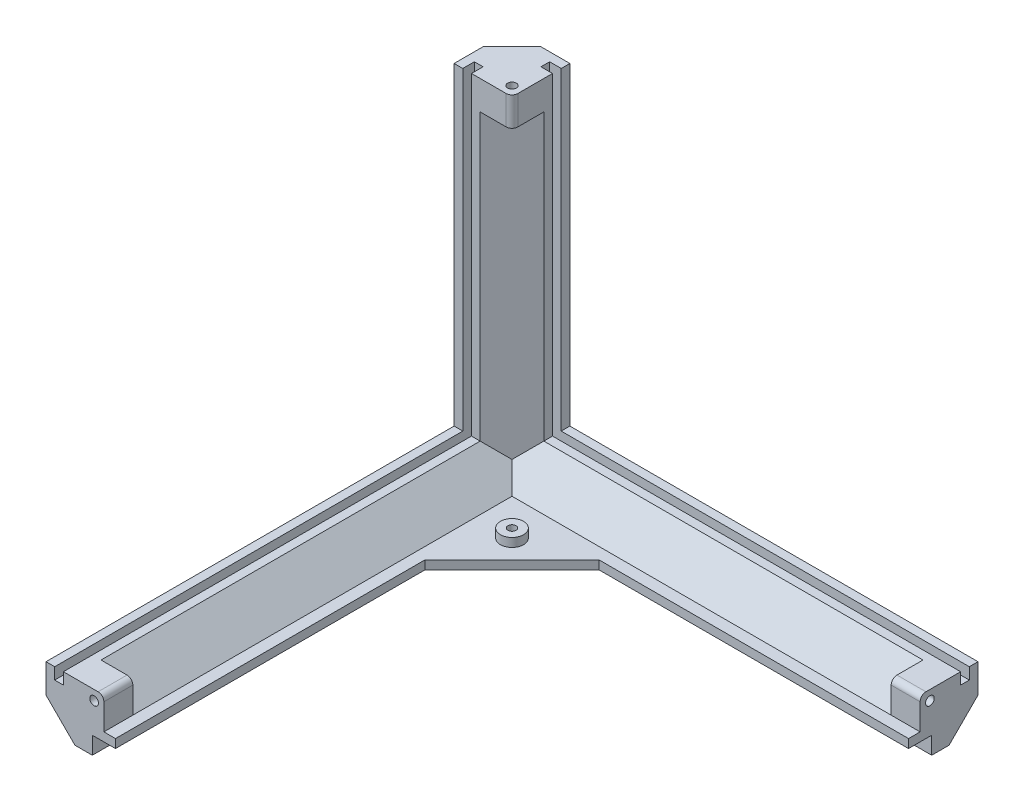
from build123d import *

# Parameters (mm, degrees)
BOSS_EXTRUDE1_DEPTH  = 108.5
BOSS_EXTRUDE2_DEPTH  = 141
BOSS_EXTRUDE3_DEPTH  = 141
SKETCH4_W            = 20
SKETCH4_H            = 20
BOSS_EXTRUDE4_DEPTH  = 20
CUT_EXTRUDE1_DEPTH   = 20
CUT_EXTRUDE2_DEPTH   = 20
CUT_EXTRUDE3_DEPTH   = 20
SKETCH8_W            = 4
SKETCH8_H            = 3
CUT_EXTRUDE4_DEPTH   = 4
SKETCH9_W            = 3
SKETCH9_H            = 4
CUT_EXTRUDE5_DEPTH   = 4
SKETCH10_W           = 3
SKETCH10_H           = 4
CUT_EXTRUDE6_DEPTH   = 4
CUT_EXTRUDE7_DEPTH   = 11
BOSS_EXTRUDE5_DEPTH  = 10
BOSS_EXTRUDE6_DEPTH  = 10
CUT_EXTRUDE8_DEPTH   = 219.425953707
SKETCH15_W           = 141
SKETCH15_H           = 3
BOSS_EXTRUDE7_DEPTH  = 4
SKETCH16_W           = 137
SKETCH16_H           = 3
BOSS_EXTRUDE8_DEPTH  = 4
CHAMFER1_SIZE        = 30
CHAMFER2_SIZE        = 20
SKETCH17_R           = 1.4
CUT_EXTRUDE9_DEPTH   = 10
SKETCH18_R           = 1.5
BOSS_EXTRUDE9_DEPTH  = 10
SKETCH19_R           = 1.5
BOSS_EXTRUDE10_DEPTH = 10
SKETCH20_R           = 1.5
BOSS_EXTRUDE11_DEPTH = 10
FILLET1_R            = 2
ESQUISSE2_R          = 4
ESQUISSE2_R_2        = 1.4
BOSS_EXTRU_1_DEPTH   = 3


with BuildPart() as part:
    # Sketch1 → Boss-Extrude1 (new body)
    with BuildSketch(Plane(origin=(0, 0, 0), x_dir=(1, 0, 0), z_dir=(0, 1, 0))):
        Polygon((-60.05786955, 3.452266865), (-50.05786955, 13.452266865), (-40.05786955, 13.452266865), (-40.05786955, 10.452266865), (-44.05786955, 10.452266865), (-44.05786955, 7.452266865), (-40.05786955, 7.452266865), (-40.05786955, 4.452266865), (-51.05786955, -6.547733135), (-54.05786955, -6.547733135), (-54.05786955, -2.547733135), (-57.05786955, -2.547733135), (-57.05786955, -6.547733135), (-60.05786955, -6.547733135), align=None)
    extrude(amount=BOSS_EXTRUDE1_DEPTH)



with BuildPart() as body_2:
    # Sketch2 → Boss-Extrude2 (new body)
    with BuildSketch(Plane.XY.offset(6.547733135)):
        Polygon((-57.05786955, 0), (-57.05786955, -4), (-54.05786955, -4), (-54.05786955, 0), (-51.05786955, 0), (-40.05786955, -11), (-40.05786955, -14), (-44.05786955, -14), (-44.05786955, -17), (-40.05786955, -17), (-40.05786955, -20), (-50.05786955, -20), (-60.05786955, -10), (-60.05786955, 0), align=None)
    extrude(amount=BOSS_EXTRUDE2_DEPTH)


with BuildPart() as body_3:
    # Sketch3 → Boss-Extrude3 (new body)
    with BuildSketch(Plane(origin=(-40.05786955, 0, 0), x_dir=(0, 0, -1), z_dir=(1, 0, 0))):
        Polygon((-6.547733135, -11), (-6.547733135, -14), (-2.547733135, -14), (-2.547733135, -17), (-6.547733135, -17), (-6.547733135, -20), (3.452266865, -20), (13.452266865, -10), (13.452266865, 0), (10.452266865, 0), (10.452266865, -4), (7.452266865, -4), (7.452266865, 0), (4.452266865, 0), align=None)
    extrude(amount=BOSS_EXTRUDE3_DEPTH)


with BuildPart() as part_1:
    add(part.part)

    add(body_2.part)  # Boss-Extrude4 merges body 2

    add(body_3.part)  # Boss-Extrude4 merges body 3
    # Sketch4 → Boss-Extrude4 (add)
    with BuildSketch(Plane(origin=(0, 0, -13.452266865), x_dir=(-1, 0, 0), z_dir=(0, 0, -1))):
        with Locations((50.05786955, -10)):
            Rectangle(SKETCH4_W, SKETCH4_H)
    extrude(amount=-BOSS_EXTRUDE4_DEPTH)

    # Sketch5 → Cut-Extrude1 (cut)
    with BuildSketch(Plane.XY.offset(6.547733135)):
        Polygon((-50.05786955, -20), (-60.05786955, -10), (-60.05786955, -20), align=None)
    extrude(amount=-CUT_EXTRUDE1_DEPTH, mode=Mode.SUBTRACT)

    # Sketch6 → Cut-Extrude2 (cut)
    with BuildSketch(Plane(origin=(0, 0, 0), x_dir=(1, 0, 0), z_dir=(0, 1, 0))):
        Polygon((-60.05786955, 3.452266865), (-50.05786955, 13.452266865), (-60.05786955, 13.452266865), align=None)
    extrude(amount=-CUT_EXTRUDE2_DEPTH, mode=Mode.SUBTRACT)

    # Sketch7 → Cut-Extrude3 (cut)
    with BuildSketch(Plane(origin=(-40.05786955, 0, 0), x_dir=(0, 0, -1), z_dir=(1, 0, 0))):
        Polygon((13.452266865, -10), (3.452266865, -20), (13.452266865, -20), align=None)
    extrude(amount=-CUT_EXTRUDE3_DEPTH, mode=Mode.SUBTRACT)

    # Sketch8 → Cut-Extrude4 (cut)
    with BuildSketch(Plane(origin=(-40.05786955, 0, 0), x_dir=(0, 0, -1), z_dir=(1, 0, 0))):
        with Locations((-4.547733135, -15.5)):
            Rectangle(SKETCH8_W, SKETCH8_H)
    extrude(amount=-CUT_EXTRUDE4_DEPTH, mode=Mode.SUBTRACT)

    # Sketch9 → Cut-Extrude5 (cut)
    with BuildSketch(Plane(origin=(-40.05786955, 0, 0), x_dir=(0, 0, -1), z_dir=(1, 0, 0))):
        with Locations((8.952266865, -2)):
            Rectangle(SKETCH9_W, SKETCH9_H)
    extrude(amount=-CUT_EXTRUDE5_DEPTH, mode=Mode.SUBTRACT)

    # Sketch10 → Cut-Extrude6 (cut)
    with BuildSketch(Plane(origin=(0, 0, 0), x_dir=(1, 0, 0), z_dir=(0, 1, 0))):
        with Locations((-55.55786955, -4.547733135)):
            Rectangle(SKETCH10_W, SKETCH10_H)
    extrude(amount=-CUT_EXTRUDE6_DEPTH, mode=Mode.SUBTRACT)

    # Sketch11 → Cut-Extrude7 (cut)
    with BuildSketch(Plane(origin=(0, 0, 0), x_dir=(1, 0, 0), z_dir=(0, 1, 0))):
        Polygon((-51.05786955, -6.547733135), (-40.05786955, 4.452266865), (-40.05786955, -6.547733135), align=None)
    extrude(amount=-CUT_EXTRUDE7_DEPTH, mode=Mode.SUBTRACT)

    # Sketch12 → Boss-Extrude5 (add)
    with BuildSketch(Plane.ZY.offset(40.05786955)):
        Polygon((6.547733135, -11), (-4.452266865, -11), (-4.452266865, 0), align=None)
    extrude(amount=BOSS_EXTRUDE5_DEPTH)

    # Sketch13 → Boss-Extrude6 (add)
    with BuildSketch(Plane(origin=(0, 0, 6.547733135), x_dir=(-1, 0, 0), z_dir=(0, 0, -1))):
        Polygon((40.05786955, -11), (51.05786955, -11), (51.05786955, 0), align=None)
    extrude(amount=BOSS_EXTRUDE6_DEPTH)

    # Sketch14 → Cut-Extrude8 (cut, through all)
    with BuildSketch(Plane(origin=(0, -17, 0), x_dir=(1, 0, 0), z_dir=(0, 1, 0))):
        Polygon((-44.05786955, -2.547733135), (-44.05786955, -147.547733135), (-40.05786955, -147.547733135), (-40.05786955, -6.547733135), (100.94213045, -6.547733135), (100.94213045, -2.547733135), align=None)
    extrude(amount=-CUT_EXTRUDE8_DEPTH, mode=Mode.SUBTRACT)

    # Sketch15 → Boss-Extrude7 (add)
    with BuildSketch(Plane.XY.offset(6.547733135)):
        with Locations((30.44213045, -12.5)):
            Rectangle(SKETCH15_W, SKETCH15_H)
    extrude(amount=BOSS_EXTRUDE7_DEPTH)

    # Sketch16 → Boss-Extrude8 (add)
    with BuildSketch(Plane(origin=(-40.05786955, 0, 0), x_dir=(0, 0, -1), z_dir=(1, 0, 0))):
        with Locations((-79.047733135, -12.5)):
            Rectangle(SKETCH16_W, SKETCH16_H)
    extrude(amount=BOSS_EXTRUDE8_DEPTH)

    # Chamfer1
    chamfer1_edges = [part_1.edges().sort_by_distance(p)[0] for p in [
        (-36.05786955, -12.5, 10.547733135),
    ]]
    chamfer(chamfer1_edges, length=CHAMFER1_SIZE)

    # Chamfer2
    chamfer2_edges = [part_1.edges().sort_by_distance(p)[0] for p in [
        (-44.05786955, -17, 2.547733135),
    ]]
    chamfer(chamfer2_edges, length=CHAMFER2_SIZE)

    # Sketch17 → Cut-Extrude9 (cut)
    with BuildSketch(Plane.XZ.offset(14)):
        with Locations(Location((-27.55786955, 19.047733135, 0), (0, 0, 270))):
            Circle(SKETCH17_R)
    extrude(amount=-CUT_EXTRUDE9_DEPTH, mode=Mode.SUBTRACT)

    # Sketch18 → Boss-Extrude9 (add)
    with BuildSketch(Plane(origin=(100.94213045, 0, 0), x_dir=(0, 0, -1), z_dir=(1, 0, 0))):
        Polygon((4.452266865, 0), (-6.547733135, 0), (-6.547733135, -11), align=None)
        with Locations((-3.169053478, -3.378679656)):
            Circle(SKETCH18_R, mode=Mode.SUBTRACT)
    extrude(amount=-BOSS_EXTRUDE9_DEPTH)

    # Sketch19 → Boss-Extrude10 (add)
    with BuildSketch(Plane.XY.offset(147.547733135)):
        Polygon((-51.05786955, 0), (-40.05786955, -11), (-40.05786955, 0), align=None)
        with Locations((-43.436549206, -3.378679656)):
            Circle(SKETCH19_R, mode=Mode.SUBTRACT)
    extrude(amount=-BOSS_EXTRUDE10_DEPTH)

    # Sketch20 → Boss-Extrude11 (add)
    with BuildSketch(Plane(origin=(0, 108.5, 0), x_dir=(1, 0, 0), z_dir=(0, 1, 0))):
        Polygon((-51.05786955, -6.547733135), (-40.05786955, -6.547733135), (-40.05786955, 4.452266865), align=None)
        with Locations(Location((-43.436549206, -3.169053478, 0), (0, 0, 270))):
            Circle(SKETCH20_R, mode=Mode.SUBTRACT)
    extrude(amount=-BOSS_EXTRUDE11_DEPTH)

    # Fillet1
    fillet1_edges = [part_1.edges().sort_by_distance(p)[0] for p in [
        (95.94213045, 0, 6.547733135),
        (-40.05786955, 0, 142.547733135),
        (-40.05786955, 103.5, 6.547733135),
    ]]
    fillet(fillet1_edges, radius=FILLET1_R)

    # Esquisse2 → Boss.-Extru.1 (add)
    with BuildSketch(Plane(origin=(0, -11, 0), x_dir=(1, 0, 0), z_dir=(0, 1, 0))):
        with Locations(Location((-27.55786955, -19.047733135, 0), (0, 0, 90))):
            Circle(ESQUISSE2_R)
        with Locations(Location((-27.55786955, -19.047733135, 0), (0, 0, 90))):
            Circle(ESQUISSE2_R_2, mode=Mode.SUBTRACT)
    extrude(amount=BOSS_EXTRU_1_DEPTH)


solid = part_1.part
